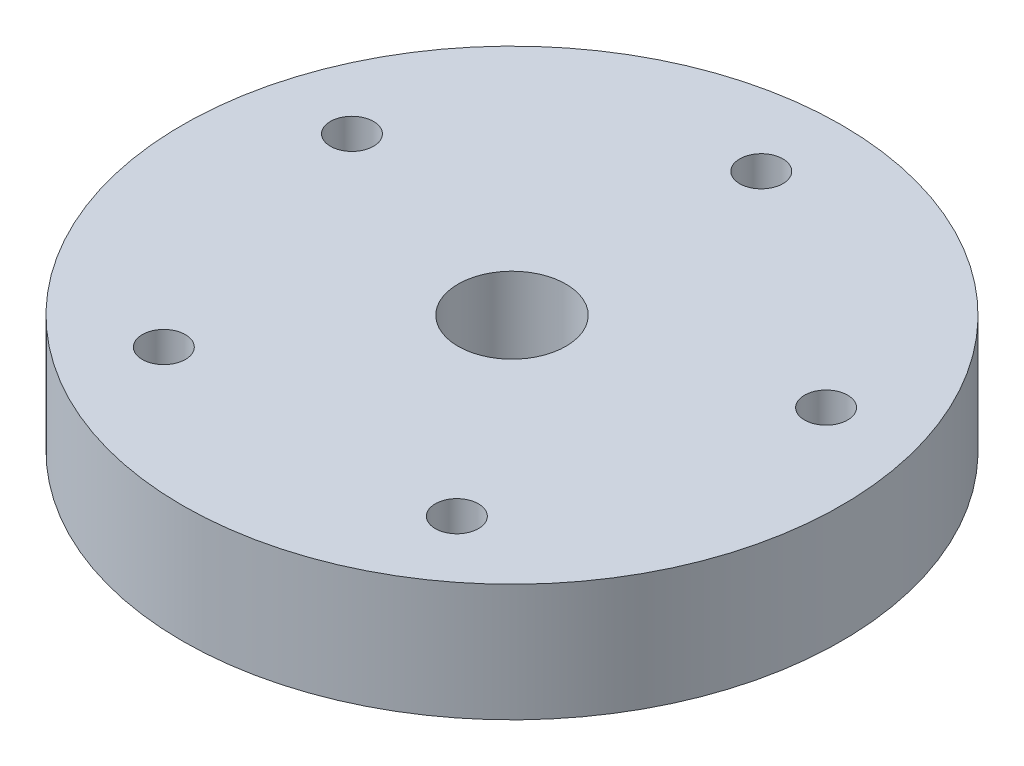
from build123d import *

# Parameters (mm, degrees)
SKETCH1_R           = 17.4625
SKETCH1_R_2         = 2.8575
SKETCH1_R_3         = 1.143
BOSS_EXTRUDE1_DEPTH = 6.223


with BuildPart() as part:
    # Sketch1 → Boss-Extrude1 (new body)
    with BuildSketch(Plane(origin=(0, 0, 0), x_dir=(1, 0, 0), z_dir=(0, 1, 0))):
        with Locations(Location((0, 0, 0), (0, 0, 270))):
            Circle(SKETCH1_R)
        with Locations(Location((0, 0, 0), (0, 0, 270))):
            Circle(SKETCH1_R_2, mode=Mode.SUBTRACT)
        with Locations(Location((0, 13.208, 0), (0, 0, 270))):
            Circle(SKETCH1_R_3, mode=Mode.SUBTRACT)
        with Locations(Location((12.561554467, 4.081496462, 0), (0, 0, 270))):
            Circle(SKETCH1_R_3, mode=Mode.SUBTRACT)
        with Locations(Location((7.763467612, -10.685496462, 0), (0, 0, 270))):
            Circle(SKETCH1_R_3, mode=Mode.SUBTRACT)
        with Locations(Location((-7.763467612, -10.685496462, 0), (0, 0, 270))):
            Circle(SKETCH1_R_3, mode=Mode.SUBTRACT)
        with Locations(Location((-12.561554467, 4.081496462, 0), (0, 0, 270))):
            Circle(SKETCH1_R_3, mode=Mode.SUBTRACT)
    extrude(amount=BOSS_EXTRUDE1_DEPTH)


solid = part.part
